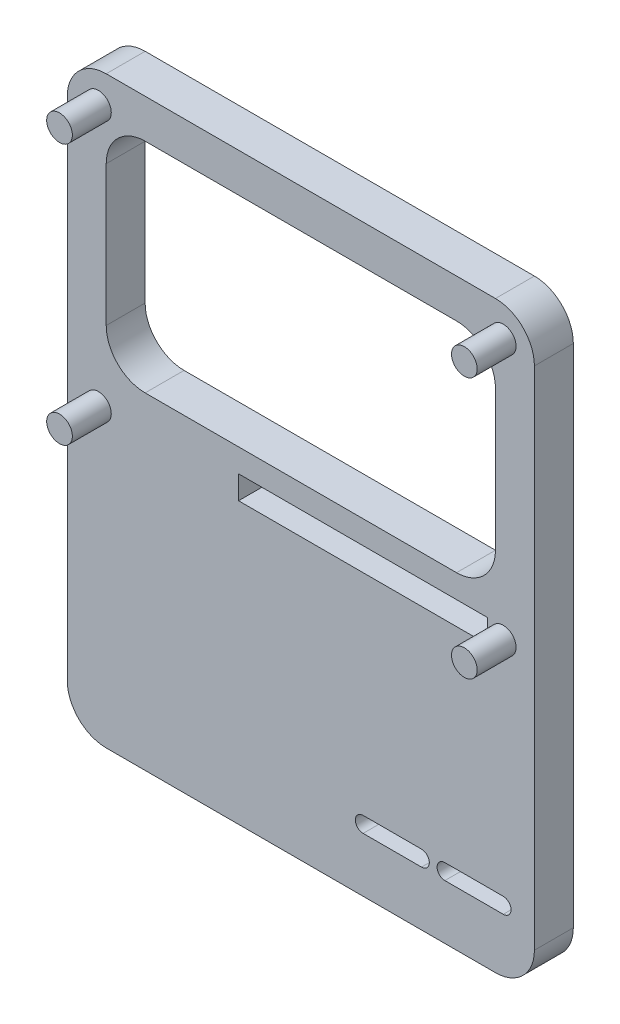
from build123d import *

# Parameters (mm, degrees)
CROQUIS1_R              = 6
CROQUIS1_R_2            = 3.5
CROQUIS1_R_3            = 2.5
CROQUIS1_W              = 32
CROQUIS1_H              = 3
SALIENTE_EXTRUIR4_DEPTH = 5
CROQUIS5_R              = 1.65
SALIENTE_EXTRUIR6_DEPTH = 5
SALIENTE_EXTRUIR7_START = -7.5
CROQUIS6_R              = 3.5
CROQUIS6_R_2            = 6
CROQUIS6_R_3            = 2.5
SALIENTE_EXTRUIR7_DEPTH = 7.5
CHAFL_N1_SIZE           = 0.5
CHAFL_N2_SIZE           = 0.5
CHAFL_N3_SIZE           = 0.5
CHAFL_N4_SIZE           = 0.5
CHAFL_N5_SIZE           = 0.5
SCALE1_SCALE            = 0.733333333


with BuildPart() as part:
    # Croquis1 → Saliente-Extruir4 (new body)
    with BuildSketch(Plane.XY):
        with BuildLine():
            Line((-25, 37.5), (25, 37.5))
            ThreePointArc((25, 37.5), (28.535533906, 36.035533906), (30, 32.5))
            Line((30, 32.5), (30, -32.5))
            ThreePointArc((30, -32.5), (28.535533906, -36.035533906), (25, -37.5))
            Line((25, -37.5), (-25, -37.5))
            ThreePointArc((-25, -37.5), (-28.535533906, -36.035533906), (-30, -32.5))
            Line((-30, -32.5), (-30, 32.5))
            ThreePointArc((-30, 32.5), (-28.535533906, 36.035533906), (-25, 37.5))
        make_face()
        with Locations((-12, -26.5)):
            Circle(CROQUIS1_R, mode=Mode.SUBTRACT)
        with Locations((-22, -17.5)):
            Circle(CROQUIS1_R_2, mode=Mode.SUBTRACT)
        with Locations((-18, 0)):
            Circle(CROQUIS1_R_3, mode=Mode.SUBTRACT)
        Polygon((-15, -17.5), (-5, -17.5), (-10, -8.839745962), align=None, mode=Mode.SUBTRACT)
        with BuildLine():
            Line((-20, 32.5), (20, 32.5))
            ThreePointArc((20, 32.5), (23.535533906, 31.035533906), (25, 27.5))
            Line((25, 27.5), (25, 9.5))
            ThreePointArc((25, 9.5), (23.535533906, 5.964466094), (20, 4.5))
            Line((20, 4.5), (-20, 4.5))
            ThreePointArc((-20, 4.5), (-23.535533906, 5.964466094), (-25, 9.5))
            Line((-25, 9.5), (-25, 27.5))
            ThreePointArc((-25, 27.5), (-23.535533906, 31.035533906), (-20, 32.5))
        make_face(mode=Mode.SUBTRACT)
        with Locations((8, 0)):
            Rectangle(CROQUIS1_W, CROQUIS1_H, mode=Mode.SUBTRACT)
        Polygon((16, -9.5), (12, -9.5), (12, -13.5), (16, -13.5), (16, -17.5), (20, -17.5), (20, -13.5), (24, -13.5), (24, -9.5), (20, -9.5), (20, -5.5), (16, -5.5), align=None, mode=Mode.SUBTRACT)
        with BuildLine():
            Line((26, -30.5), (18.5, -30.5))
            ThreePointArc((18.5, -30.5), (17.5, -29.5), (18.5, -28.5))
            Line((18.5, -28.5), (26, -28.5))
            ThreePointArc((26, -28.5), (27, -29.5), (26, -30.5))
        make_face(mode=Mode.SUBTRACT)
        with BuildLine():
            Line((15.5, -30.5), (8, -30.5))
            ThreePointArc((8, -30.5), (7, -29.5), (8, -28.5))
            Line((8, -28.5), (15.5, -28.5))
            ThreePointArc((15.5, -28.5), (16.5, -29.5), (15.5, -30.5))
        make_face(mode=Mode.SUBTRACT)
    extrude(amount=SALIENTE_EXTRUIR4_DEPTH)

    # Croquis5 → Saliente-Extruir6 (add)
    with BuildSketch(Plane.XY.offset(5)):
        with Locations((-26, 0)):
            Circle(CROQUIS5_R)
        with Locations(Location((26, 0, 0), (0, 0, 180))):
            Circle(CROQUIS5_R)
        with Locations((-26, 33.5)):
            Circle(CROQUIS5_R)
        with Locations(Location((26, 33.5, 0), (0, 0, 180))):
            Circle(CROQUIS5_R)
    extrude(amount=SALIENTE_EXTRUIR6_DEPTH)

    # Croquis6 → Saliente-Extruir7 (add)
    with BuildSketch(Plane.XY.offset(5).offset(SALIENTE_EXTRUIR7_START)):
        with Locations((-22, -17.5)):
            Circle(CROQUIS6_R)
        with Locations((-12, -26.5)):
            Circle(CROQUIS6_R_2)
        with Locations((-18, 0)):
            Circle(CROQUIS6_R_3)
        Polygon((-15, -17.5), (-10, -8.839745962), (-5, -17.5), align=None)
        Polygon((20, -13.5), (20, -17.5), (16, -17.5), (16, -13.5), (12, -13.5), (12, -9.5), (16, -9.5), (16, -5.5), (20, -5.5), (20, -9.5), (24, -9.5), (24, -13.5), align=None)
    extrude(amount=SALIENTE_EXTRUIR7_DEPTH)

    # Chafl_n1
    chafl_n1_edges = [part.edges().sort_by_distance(p)[0] for p in [
        (22, -9.5, -2.5),
        (20, -7.5, -2.5),
        (18, -5.5, -2.5),
        (16, -7.5, -2.5),
        (14, -9.5, -2.5),
        (12, -11.5, -2.5),
        (14, -13.5, -2.5),
        (16, -15.5, -2.5),
        (22, -13.5, -2.5),
        (18, -17.5, -2.5),
        (20, -15.5, -2.5),
        (24, -11.5, -2.5),
    ]]
    chamfer(chafl_n1_edges, length=CHAFL_N1_SIZE)

    # Chafl_n2
    chafl_n2_edges = [part.edges().sort_by_distance(p)[0] for p in [
        (-7.5, -13.169872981, -2.5),
        (-10, -17.5, -2.5),
        (-12.5, -13.169872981, -2.5),
    ]]
    chamfer(chafl_n2_edges, length=CHAFL_N2_SIZE)

    # Chafl_n3
    chafl_n3_edges = [part.edges().sort_by_distance(p)[0] for p in [
        (-18, -26.5, -2.5),
    ]]
    chamfer(chafl_n3_edges, length=CHAFL_N3_SIZE)

    # Chafl_n4
    chafl_n4_edges = [part.edges().sort_by_distance(p)[0] for p in [
        (-25.5, -17.5, -2.5),
    ]]
    chamfer(chafl_n4_edges, length=CHAFL_N4_SIZE)

    # Chafl_n5
    chafl_n5_edges = [part.edges().sort_by_distance(p)[0] for p in [
        (-20.5, 0, -2.5),
    ]]
    chamfer(chafl_n5_edges, length=CHAFL_N5_SIZE)


with BuildPart() as part_1:
    # Scale1: scaled about (-0.681851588, -8.397390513, 2.38447573)
    add(part.part.scale(SCALE1_SCALE).moved(Location((-0.18182709, -2.23930414, 0.635860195))))


solid = part_1.part
